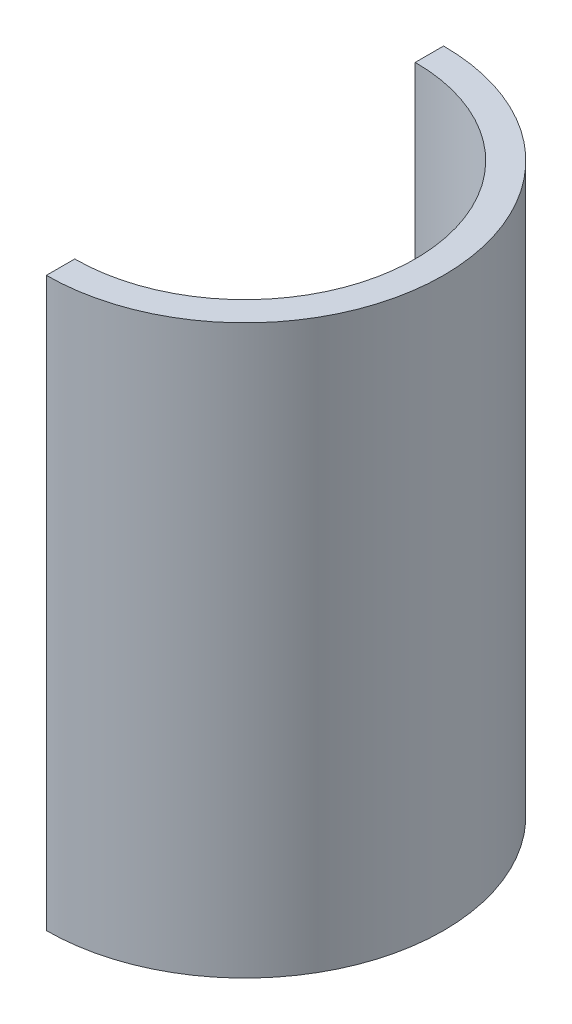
ISO-10303-21;
HEADER;
FILE_DESCRIPTION(('STEP AP214'),'2;1');
FILE_NAME('part.step','',(''),(''),'','','');
FILE_SCHEMA(('AUTOMOTIVE_DESIGN { 1 0 10303 214 1 1 1 1 }'));
ENDSEC;
DATA;
#1=APPLICATION_CONTEXT('core data for automotive mechanical design processes');
#2=APPLICATION_PROTOCOL_DEFINITION('international standard','automotive_design',2000,#1);
#3=PRODUCT_CONTEXT('',#1,'mechanical');
#4=PRODUCT('Part','Part','',(#3));
#5=PRODUCT_RELATED_PRODUCT_CATEGORY('part','',(#4));
#6=PRODUCT_DEFINITION_FORMATION('','',#4);
#7=PRODUCT_DEFINITION_CONTEXT('part definition',#1,'design');
#8=PRODUCT_DEFINITION('design','',#6,#7);
#9=PRODUCT_DEFINITION_SHAPE('','',#8);
#10=(LENGTH_UNIT() NAMED_UNIT(*) SI_UNIT(.MILLI.,.METRE.));
#11=(NAMED_UNIT(*) PLANE_ANGLE_UNIT() SI_UNIT($,.RADIAN.));
#12=(NAMED_UNIT(*) SI_UNIT($,.STERADIAN.) SOLID_ANGLE_UNIT());
#13=UNCERTAINTY_MEASURE_WITH_UNIT(LENGTH_MEASURE(1.E-05),#10,'distance_accuracy_value','');
#14=(GEOMETRIC_REPRESENTATION_CONTEXT(3) GLOBAL_UNCERTAINTY_ASSIGNED_CONTEXT((#13)) GLOBAL_UNIT_ASSIGNED_CONTEXT((#10,
#11,#12)) REPRESENTATION_CONTEXT('',''));
#15=CARTESIAN_POINT('',(0.,0.,0.));
#16=DIRECTION('',(0.,0.,1.));
#17=DIRECTION('',(1.,0.,0.));
#18=AXIS2_PLACEMENT_3D('',#15,#16,#17);
#19=CARTESIAN_POINT('',(-1.04744440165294E-13,-25.,15.));
#20=DIRECTION('',(0.,1.,0.));
#21=DIRECTION('',(0.,0.,1.));
#22=AXIS2_PLACEMENT_3D('',#19,#20,#21);
#23=PLANE('',#22);
#24=CARTESIAN_POINT('',(0.,-25.,0.));
#25=DIRECTION('',(0.,1.,0.));
#26=DIRECTION('',(0.,0.,1.));
#27=AXIS2_PLACEMENT_3D('',#24,#25,#26);
#28=CIRCLE('',#27,17.5);
#29=CARTESIAN_POINT('',(-1.2220184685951E-13,-25.,17.5));
#30=VERTEX_POINT('',#29);
#31=CARTESIAN_POINT('',(0.,-25.,-17.5));
#32=VERTEX_POINT('',#31);
#33=EDGE_CURVE('E11',#30,#32,#28,.T.);
#34=ORIENTED_EDGE('',*,*,#33,.F.);
#35=DIRECTION('',(0.,0.,1.));
#36=VECTOR('',#35,1.);
#37=CARTESIAN_POINT('',(-1.04744440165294E-13,-25.,15.));
#38=LINE('',#37,#36);
#39=CARTESIAN_POINT('',(-1.04744440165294E-13,-25.,15.));
#40=VERTEX_POINT('',#39);
#41=EDGE_CURVE('E104',#40,#30,#38,.T.);
#42=ORIENTED_EDGE('',*,*,#41,.F.);
#43=CARTESIAN_POINT('',(0.,-25.,0.));
#44=DIRECTION('',(0.,1.,0.));
#45=DIRECTION('',(0.,0.,1.));
#46=AXIS2_PLACEMENT_3D('',#43,#44,#45);
#47=CIRCLE('',#46,15.);
#48=CARTESIAN_POINT('',(0.,-25.,-15.));
#49=VERTEX_POINT('',#48);
#50=EDGE_CURVE('E57',#40,#49,#47,.T.);
#51=ORIENTED_EDGE('',*,*,#50,.T.);
#52=DIRECTION('',(0.,0.,-1.));
#53=VECTOR('',#52,1.);
#54=CARTESIAN_POINT('',(0.,-25.,-15.));
#55=LINE('',#54,#53);
#56=EDGE_CURVE('E93',#49,#32,#55,.T.);
#57=ORIENTED_EDGE('',*,*,#56,.T.);
#58=EDGE_LOOP('',(#34,#42,#51,#57));
#59=FACE_BOUND('',#58,.T.);
#60=ADVANCED_FACE('F42',(#59),#23,.F.);
#61=CARTESIAN_POINT('',(0.,0.,0.));
#62=DIRECTION('',(0.,1.,0.));
#63=DIRECTION('',(0.,0.,1.));
#64=AXIS2_PLACEMENT_3D('',#61,#62,#63);
#65=CYLINDRICAL_SURFACE('',#64,17.5);
#66=CARTESIAN_POINT('',(0.,25.,0.));
#67=DIRECTION('',(0.,1.,0.));
#68=DIRECTION('',(0.,0.,1.));
#69=AXIS2_PLACEMENT_3D('',#66,#67,#68);
#70=CIRCLE('',#69,17.5);
#71=CARTESIAN_POINT('',(-1.2220184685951E-13,25.,17.5));
#72=VERTEX_POINT('',#71);
#73=CARTESIAN_POINT('',(0.,25.,-17.5));
#74=VERTEX_POINT('',#73);
#75=EDGE_CURVE('E50',#72,#74,#70,.T.);
#76=ORIENTED_EDGE('',*,*,#75,.F.);
#77=DIRECTION('',(0.,1.,0.));
#78=VECTOR('',#77,1.);
#79=CARTESIAN_POINT('',(-1.2220184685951E-13,-25.,17.5));
#80=LINE('',#79,#78);
#81=EDGE_CURVE('E89',#30,#72,#80,.T.);
#82=ORIENTED_EDGE('',*,*,#81,.F.);
#83=ORIENTED_EDGE('',*,*,#33,.T.);
#84=DIRECTION('',(0.,1.,0.));
#85=VECTOR('',#84,1.);
#86=CARTESIAN_POINT('',(0.,-25.,-17.5));
#87=LINE('',#86,#85);
#88=EDGE_CURVE('E86',#32,#74,#87,.T.);
#89=ORIENTED_EDGE('',*,*,#88,.T.);
#90=EDGE_LOOP('',(#76,#82,#83,#89));
#91=FACE_BOUND('',#90,.T.);
#92=ADVANCED_FACE('F44',(#91),#65,.T.);
#93=CARTESIAN_POINT('',(-1.04744440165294E-13,25.,15.));
#94=DIRECTION('',(0.,1.,0.));
#95=DIRECTION('',(0.,0.,1.));
#96=AXIS2_PLACEMENT_3D('',#93,#94,#95);
#97=PLANE('',#96);
#98=CARTESIAN_POINT('',(0.,25.,0.));
#99=DIRECTION('',(0.,1.,0.));
#100=DIRECTION('',(0.,0.,1.));
#101=AXIS2_PLACEMENT_3D('',#98,#99,#100);
#102=CIRCLE('',#101,15.);
#103=CARTESIAN_POINT('',(-1.04744440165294E-13,25.,15.));
#104=VERTEX_POINT('',#103);
#105=CARTESIAN_POINT('',(0.,25.,-15.));
#106=VERTEX_POINT('',#105);
#107=EDGE_CURVE('E65',#104,#106,#102,.T.);
#108=ORIENTED_EDGE('',*,*,#107,.F.);
#109=DIRECTION('',(0.,0.,1.));
#110=VECTOR('',#109,1.);
#111=CARTESIAN_POINT('',(-1.04744440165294E-13,25.,15.));
#112=LINE('',#111,#110);
#113=EDGE_CURVE('E107',#104,#72,#112,.T.);
#114=ORIENTED_EDGE('',*,*,#113,.T.);
#115=ORIENTED_EDGE('',*,*,#75,.T.);
#116=DIRECTION('',(0.,0.,-1.));
#117=VECTOR('',#116,1.);
#118=CARTESIAN_POINT('',(0.,25.,-15.));
#119=LINE('',#118,#117);
#120=EDGE_CURVE('E98',#106,#74,#119,.T.);
#121=ORIENTED_EDGE('',*,*,#120,.F.);
#122=EDGE_LOOP('',(#108,#114,#115,#121));
#123=FACE_BOUND('',#122,.T.);
#124=ADVANCED_FACE('F112',(#123),#97,.T.);
#125=CARTESIAN_POINT('',(0.,0.,0.));
#126=DIRECTION('',(0.,1.,0.));
#127=DIRECTION('',(0.,0.,1.));
#128=AXIS2_PLACEMENT_3D('',#125,#126,#127);
#129=CYLINDRICAL_SURFACE('',#128,15.);
#130=DIRECTION('',(0.,1.,0.));
#131=VECTOR('',#130,1.);
#132=CARTESIAN_POINT('',(-1.04744440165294E-13,-25.,15.));
#133=LINE('',#132,#131);
#134=EDGE_CURVE('E109',#40,#104,#133,.T.);
#135=ORIENTED_EDGE('',*,*,#134,.T.);
#136=ORIENTED_EDGE('',*,*,#107,.T.);
#137=DIRECTION('',(0.,1.,0.));
#138=VECTOR('',#137,1.);
#139=CARTESIAN_POINT('',(0.,-25.,-15.));
#140=LINE('',#139,#138);
#141=EDGE_CURVE('E100',#49,#106,#140,.T.);
#142=ORIENTED_EDGE('',*,*,#141,.F.);
#143=ORIENTED_EDGE('',*,*,#50,.F.);
#144=EDGE_LOOP('',(#135,#136,#142,#143));
#145=FACE_BOUND('',#144,.T.);
#146=ADVANCED_FACE('F116',(#145),#129,.F.);
#147=CARTESIAN_POINT('',(0.,0.,0.));
#148=DIRECTION('',(-1.,0.,0.));
#149=DIRECTION('',(0.,0.,1.));
#150=AXIS2_PLACEMENT_3D('',#147,#148,#149);
#151=PLANE('',#150);
#152=ORIENTED_EDGE('',*,*,#41,.T.);
#153=ORIENTED_EDGE('',*,*,#81,.T.);
#154=ORIENTED_EDGE('',*,*,#113,.F.);
#155=ORIENTED_EDGE('',*,*,#134,.F.);
#156=EDGE_LOOP('',(#152,#153,#154,#155));
#157=FACE_BOUND('',#156,.T.);
#158=ADVANCED_FACE('F114',(#157),#151,.T.);
#159=CARTESIAN_POINT('',(0.,0.,0.));
#160=DIRECTION('',(1.,0.,0.));
#161=DIRECTION('',(0.,0.,-1.));
#162=AXIS2_PLACEMENT_3D('',#159,#160,#161);
#163=PLANE('',#162);
#164=ORIENTED_EDGE('',*,*,#56,.F.);
#165=ORIENTED_EDGE('',*,*,#141,.T.);
#166=ORIENTED_EDGE('',*,*,#120,.T.);
#167=ORIENTED_EDGE('',*,*,#88,.F.);
#168=EDGE_LOOP('',(#164,#165,#166,#167));
#169=FACE_BOUND('',#168,.T.);
#170=ADVANCED_FACE('F97',(#169),#163,.F.);
#171=CLOSED_SHELL('',(#60,#92,#124,#146,#158,#170));
#172=MANIFOLD_SOLID_BREP('B2',#171);
#173=ADVANCED_BREP_SHAPE_REPRESENTATION('',(#18,#172),#14);
#174=SHAPE_DEFINITION_REPRESENTATION(#9,#173);
ENDSEC;
END-ISO-10303-21;
